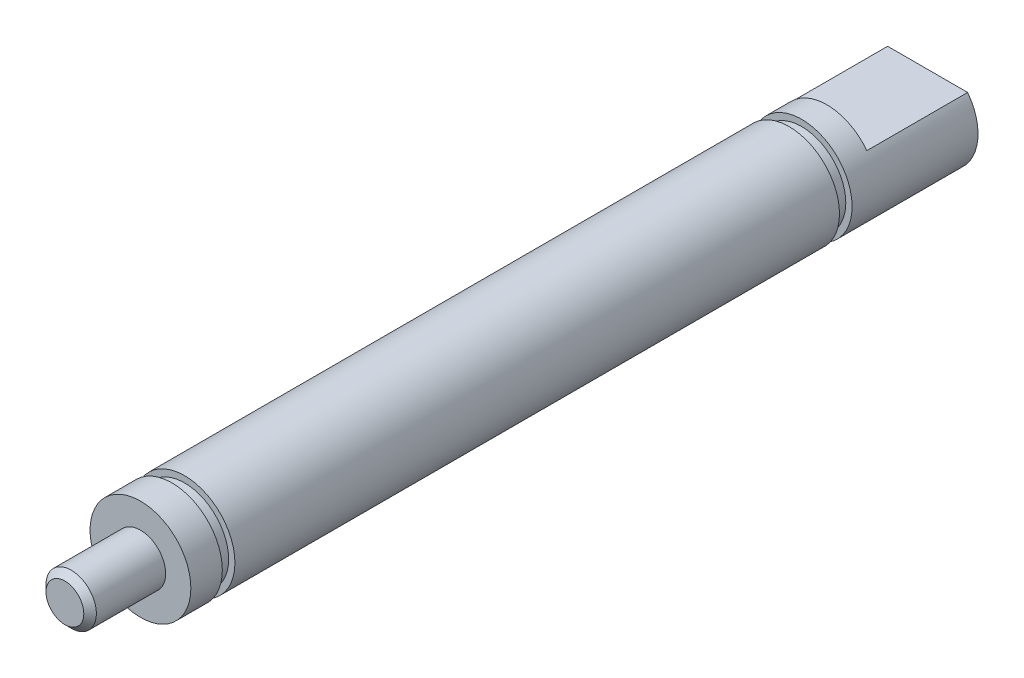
ISO-10303-21;
HEADER;
FILE_DESCRIPTION(('STEP AP214'),'2;1');
FILE_NAME('part.step','',(''),(''),'','','');
FILE_SCHEMA(('AUTOMOTIVE_DESIGN { 1 0 10303 214 1 1 1 1 }'));
ENDSEC;
DATA;
#1=APPLICATION_CONTEXT('core data for automotive mechanical design processes');
#2=APPLICATION_PROTOCOL_DEFINITION('international standard','automotive_design',2000,#1);
#3=PRODUCT_CONTEXT('',#1,'mechanical');
#4=PRODUCT('Part','Part','',(#3));
#5=PRODUCT_RELATED_PRODUCT_CATEGORY('part','',(#4));
#6=PRODUCT_DEFINITION_FORMATION('','',#4);
#7=PRODUCT_DEFINITION_CONTEXT('part definition',#1,'design');
#8=PRODUCT_DEFINITION('design','',#6,#7);
#9=PRODUCT_DEFINITION_SHAPE('','',#8);
#10=(LENGTH_UNIT() NAMED_UNIT(*) SI_UNIT(.MILLI.,.METRE.));
#11=(NAMED_UNIT(*) PLANE_ANGLE_UNIT() SI_UNIT($,.RADIAN.));
#12=(NAMED_UNIT(*) SI_UNIT($,.STERADIAN.) SOLID_ANGLE_UNIT());
#13=UNCERTAINTY_MEASURE_WITH_UNIT(LENGTH_MEASURE(1.E-05),#10,'distance_accuracy_value','');
#14=(GEOMETRIC_REPRESENTATION_CONTEXT(3) GLOBAL_UNCERTAINTY_ASSIGNED_CONTEXT((#13)) GLOBAL_UNIT_ASSIGNED_CONTEXT((#10,
#11,#12)) REPRESENTATION_CONTEXT('',''));
#15=CARTESIAN_POINT('',(0.,0.,0.));
#16=DIRECTION('',(0.,0.,1.));
#17=DIRECTION('',(1.,0.,0.));
#18=AXIS2_PLACEMENT_3D('',#15,#16,#17);
#19=CARTESIAN_POINT('',(0.,0.,31.25));
#20=DIRECTION('',(0.,0.,1.));
#21=DIRECTION('',(1.,0.,0.));
#22=AXIS2_PLACEMENT_3D('',#19,#20,#21);
#23=PLANE('',#22);
#24=CARTESIAN_POINT('',(0.,0.,31.25));
#25=DIRECTION('',(0.,0.,1.));
#26=DIRECTION('',(1.,0.,0.));
#27=AXIS2_PLACEMENT_3D('',#24,#25,#26);
#28=CIRCLE('',#27,2.);
#29=CARTESIAN_POINT('',(2.,0.,31.25));
#30=VERTEX_POINT('',#29);
#31=EDGE_CURVE('E224',#30,#30,#28,.T.);
#32=ORIENTED_EDGE('',*,*,#31,.T.);
#33=EDGE_LOOP('',(#32));
#34=FACE_BOUND('',#33,.T.);
#35=CARTESIAN_POINT('',(0.,0.,31.25));
#36=DIRECTION('',(0.,0.,1.));
#37=DIRECTION('',(1.,0.,0.));
#38=AXIS2_PLACEMENT_3D('',#35,#36,#37);
#39=CIRCLE('',#38,1.);
#40=CARTESIAN_POINT('',(1.,0.,31.25));
#41=VERTEX_POINT('',#40);
#42=EDGE_CURVE('E229',#41,#41,#39,.T.);
#43=ORIENTED_EDGE('',*,*,#42,.F.);
#44=EDGE_LOOP('',(#43));
#45=FACE_BOUND('',#44,.T.);
#46=ADVANCED_FACE('F26',(#34,#45),#23,.T.);
#47=CARTESIAN_POINT('',(0.,0.,30.));
#48=DIRECTION('',(0.,0.,1.));
#49=DIRECTION('',(1.,0.,0.));
#50=AXIS2_PLACEMENT_3D('',#47,#48,#49);
#51=PLANE('',#50);
#52=CARTESIAN_POINT('',(0.,0.,30.));
#53=DIRECTION('',(0.,0.,1.));
#54=DIRECTION('',(1.,0.,0.));
#55=AXIS2_PLACEMENT_3D('',#52,#53,#54);
#56=CIRCLE('',#55,2.);
#57=CARTESIAN_POINT('',(2.,0.,30.));
#58=VERTEX_POINT('',#57);
#59=EDGE_CURVE('E226',#58,#58,#56,.T.);
#60=ORIENTED_EDGE('',*,*,#59,.F.);
#61=EDGE_LOOP('',(#60));
#62=FACE_BOUND('',#61,.T.);
#63=CARTESIAN_POINT('',(0.,0.,30.));
#64=DIRECTION('',(0.,0.,1.));
#65=DIRECTION('',(1.,0.,0.));
#66=AXIS2_PLACEMENT_3D('',#63,#64,#65);
#67=CIRCLE('',#66,1.75);
#68=CARTESIAN_POINT('',(1.75,0.,30.));
#69=VERTEX_POINT('',#68);
#70=EDGE_CURVE('E218',#69,#69,#67,.T.);
#71=ORIENTED_EDGE('',*,*,#70,.T.);
#72=EDGE_LOOP('',(#71));
#73=FACE_BOUND('',#72,.T.);
#74=ADVANCED_FACE('F98',(#62,#73),#51,.F.);
#75=CARTESIAN_POINT('',(0.,0.,31.25));
#76=DIRECTION('',(0.,0.,-1.));
#77=DIRECTION('',(-1.,0.,0.));
#78=AXIS2_PLACEMENT_3D('',#75,#76,#77);
#79=CYLINDRICAL_SURFACE('',#78,2.);
#80=ORIENTED_EDGE('',*,*,#31,.F.);
#81=EDGE_LOOP('',(#80));
#82=FACE_BOUND('',#81,.T.);
#83=ORIENTED_EDGE('',*,*,#59,.T.);
#84=EDGE_LOOP('',(#83));
#85=FACE_BOUND('',#84,.T.);
#86=ADVANCED_FACE('F104',(#82,#85),#79,.T.);
#87=CARTESIAN_POINT('',(0.,0.,29.5));
#88=DIRECTION('',(0.,0.,1.));
#89=DIRECTION('',(1.,0.,0.));
#90=AXIS2_PLACEMENT_3D('',#87,#88,#89);
#91=PLANE('',#90);
#92=CARTESIAN_POINT('',(0.,0.,29.5));
#93=DIRECTION('',(0.,0.,1.));
#94=DIRECTION('',(1.,0.,0.));
#95=AXIS2_PLACEMENT_3D('',#92,#93,#94);
#96=CIRCLE('',#95,2.);
#97=CARTESIAN_POINT('',(2.,0.,29.5));
#98=VERTEX_POINT('',#97);
#99=EDGE_CURVE('E211',#98,#98,#96,.T.);
#100=ORIENTED_EDGE('',*,*,#99,.T.);
#101=EDGE_LOOP('',(#100));
#102=FACE_BOUND('',#101,.T.);
#103=CARTESIAN_POINT('',(0.,0.,29.5));
#104=DIRECTION('',(0.,0.,1.));
#105=DIRECTION('',(1.,0.,0.));
#106=AXIS2_PLACEMENT_3D('',#103,#104,#105);
#107=CIRCLE('',#106,1.75);
#108=CARTESIAN_POINT('',(1.75,0.,29.5));
#109=VERTEX_POINT('',#108);
#110=EDGE_CURVE('E221',#109,#109,#107,.T.);
#111=ORIENTED_EDGE('',*,*,#110,.F.);
#112=EDGE_LOOP('',(#111));
#113=FACE_BOUND('',#112,.T.);
#114=ADVANCED_FACE('F112',(#102,#113),#91,.T.);
#115=CARTESIAN_POINT('',(0.,0.,5.5));
#116=DIRECTION('',(0.,0.,1.));
#117=DIRECTION('',(1.,0.,0.));
#118=AXIS2_PLACEMENT_3D('',#115,#116,#117);
#119=PLANE('',#118);
#120=CARTESIAN_POINT('',(0.,0.,5.5));
#121=DIRECTION('',(0.,0.,1.));
#122=DIRECTION('',(1.,0.,0.));
#123=AXIS2_PLACEMENT_3D('',#120,#121,#122);
#124=CIRCLE('',#123,2.);
#125=CARTESIAN_POINT('',(2.,0.,5.5));
#126=VERTEX_POINT('',#125);
#127=EDGE_CURVE('E213',#126,#126,#124,.T.);
#128=ORIENTED_EDGE('',*,*,#127,.F.);
#129=EDGE_LOOP('',(#128));
#130=FACE_BOUND('',#129,.T.);
#131=CARTESIAN_POINT('',(0.,0.,5.5));
#132=DIRECTION('',(0.,0.,1.));
#133=DIRECTION('',(1.,0.,0.));
#134=AXIS2_PLACEMENT_3D('',#131,#132,#133);
#135=CIRCLE('',#134,1.75);
#136=CARTESIAN_POINT('',(1.75,0.,5.5));
#137=VERTEX_POINT('',#136);
#138=EDGE_CURVE('E67',#137,#137,#135,.T.);
#139=ORIENTED_EDGE('',*,*,#138,.T.);
#140=EDGE_LOOP('',(#139));
#141=FACE_BOUND('',#140,.T.);
#142=ADVANCED_FACE('F118',(#130,#141),#119,.F.);
#143=CARTESIAN_POINT('',(0.,0.,29.5));
#144=DIRECTION('',(0.,0.,-1.));
#145=DIRECTION('',(-1.,0.,0.));
#146=AXIS2_PLACEMENT_3D('',#143,#144,#145);
#147=CYLINDRICAL_SURFACE('',#146,2.);
#148=ORIENTED_EDGE('',*,*,#99,.F.);
#149=EDGE_LOOP('',(#148));
#150=FACE_BOUND('',#149,.T.);
#151=ORIENTED_EDGE('',*,*,#127,.T.);
#152=EDGE_LOOP('',(#151));
#153=FACE_BOUND('',#152,.T.);
#154=ADVANCED_FACE('F121',(#150,#153),#147,.T.);
#155=CARTESIAN_POINT('',(0.,0.,5.));
#156=DIRECTION('',(0.,0.,1.));
#157=DIRECTION('',(1.,0.,0.));
#158=AXIS2_PLACEMENT_3D('',#155,#156,#157);
#159=PLANE('',#158);
#160=CARTESIAN_POINT('',(0.,0.,5.));
#161=DIRECTION('',(0.,0.,1.));
#162=DIRECTION('',(1.,0.,0.));
#163=AXIS2_PLACEMENT_3D('',#160,#161,#162);
#164=CIRCLE('',#163,2.);
#165=CARTESIAN_POINT('',(2.,0.,5.));
#166=VERTEX_POINT('',#165);
#167=EDGE_CURVE('E66',#166,#166,#164,.T.);
#168=ORIENTED_EDGE('',*,*,#167,.T.);
#169=EDGE_LOOP('',(#168));
#170=FACE_BOUND('',#169,.T.);
#171=CARTESIAN_POINT('',(0.,0.,5.));
#172=DIRECTION('',(0.,0.,1.));
#173=DIRECTION('',(1.,0.,0.));
#174=AXIS2_PLACEMENT_3D('',#171,#172,#173);
#175=CIRCLE('',#174,1.75);
#176=CARTESIAN_POINT('',(1.75,0.,5.));
#177=VERTEX_POINT('',#176);
#178=EDGE_CURVE('E72',#177,#177,#175,.T.);
#179=ORIENTED_EDGE('',*,*,#178,.F.);
#180=EDGE_LOOP('',(#179));
#181=FACE_BOUND('',#180,.T.);
#182=ADVANCED_FACE('F128',(#170,#181),#159,.T.);
#183=CARTESIAN_POINT('',(0.,0.,4.));
#184=DIRECTION('',(0.,0.,1.));
#185=DIRECTION('',(1.,0.,0.));
#186=AXIS2_PLACEMENT_3D('',#183,#184,#185);
#187=PLANE('',#186);
#188=DIRECTION('',(1.,0.,0.));
#189=VECTOR('',#188,1.);
#190=CARTESIAN_POINT('',(-1.58739525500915,1.21662496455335,4.));
#191=LINE('',#190,#189);
#192=CARTESIAN_POINT('',(-1.58739525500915,1.21662496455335,4.));
#193=VERTEX_POINT('',#192);
#194=CARTESIAN_POINT('',(1.58739525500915,1.21662496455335,4.));
#195=VERTEX_POINT('',#194);
#196=EDGE_CURVE('E52',#193,#195,#191,.T.);
#197=ORIENTED_EDGE('',*,*,#196,.F.);
#198=CARTESIAN_POINT('',(0.,0.,4.));
#199=DIRECTION('',(0.,0.,1.));
#200=DIRECTION('',(1.,0.,0.));
#201=AXIS2_PLACEMENT_3D('',#198,#199,#200);
#202=CIRCLE('',#201,2.);
#203=EDGE_CURVE('E61',#195,#193,#202,.T.);
#204=ORIENTED_EDGE('',*,*,#203,.F.);
#205=EDGE_LOOP('',(#197,#204));
#206=FACE_BOUND('',#205,.T.);
#207=ADVANCED_FACE('F65',(#206),#187,.F.);
#208=CARTESIAN_POINT('',(0.,0.,4.));
#209=DIRECTION('',(0.,0.,-1.));
#210=DIRECTION('',(-1.,0.,0.));
#211=AXIS2_PLACEMENT_3D('',#208,#209,#210);
#212=CYLINDRICAL_SURFACE('',#211,2.);
#213=DIRECTION('',(0.,0.,-1.));
#214=VECTOR('',#213,1.);
#215=CARTESIAN_POINT('',(1.58739525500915,1.21662496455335,4.));
#216=LINE('',#215,#214);
#217=CARTESIAN_POINT('',(1.58739525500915,1.21662496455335,0.));
#218=VERTEX_POINT('',#217);
#219=EDGE_CURVE('E54',#195,#218,#216,.T.);
#220=ORIENTED_EDGE('',*,*,#219,.F.);
#221=ORIENTED_EDGE('',*,*,#203,.T.);
#222=DIRECTION('',(0.,0.,-1.));
#223=VECTOR('',#222,1.);
#224=CARTESIAN_POINT('',(-1.58739525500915,1.21662496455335,4.));
#225=LINE('',#224,#223);
#226=CARTESIAN_POINT('',(-1.58739525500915,1.21662496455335,0.));
#227=VERTEX_POINT('',#226);
#228=EDGE_CURVE('E41',#193,#227,#225,.T.);
#229=ORIENTED_EDGE('',*,*,#228,.T.);
#230=CARTESIAN_POINT('',(0.,0.,0.));
#231=DIRECTION('',(0.,0.,1.));
#232=DIRECTION('',(1.,0.,0.));
#233=AXIS2_PLACEMENT_3D('',#230,#231,#232);
#234=CIRCLE('',#233,2.);
#235=EDGE_CURVE('E62',#227,#218,#234,.T.);
#236=ORIENTED_EDGE('',*,*,#235,.T.);
#237=EDGE_LOOP('',(#220,#221,#229,#236));
#238=FACE_BOUND('',#237,.T.);
#239=ORIENTED_EDGE('',*,*,#167,.F.);
#240=EDGE_LOOP('',(#239));
#241=FACE_BOUND('',#240,.T.);
#242=ADVANCED_FACE('F59',(#238,#241),#212,.T.);
#243=CARTESIAN_POINT('',(-1.58739525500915,1.21662496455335,4.));
#244=DIRECTION('',(0.,1.,0.));
#245=DIRECTION('',(0.,0.,1.));
#246=AXIS2_PLACEMENT_3D('',#243,#244,#245);
#247=PLANE('',#246);
#248=ORIENTED_EDGE('',*,*,#196,.T.);
#249=ORIENTED_EDGE('',*,*,#219,.T.);
#250=DIRECTION('',(1.,0.,0.));
#251=VECTOR('',#250,1.);
#252=CARTESIAN_POINT('',(-1.58739525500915,1.21662496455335,0.));
#253=LINE('',#252,#251);
#254=EDGE_CURVE('E57',#227,#218,#253,.T.);
#255=ORIENTED_EDGE('',*,*,#254,.F.);
#256=ORIENTED_EDGE('',*,*,#228,.F.);
#257=EDGE_LOOP('',(#248,#249,#255,#256));
#258=FACE_BOUND('',#257,.T.);
#259=ADVANCED_FACE('F28',(#258),#247,.T.);
#260=CARTESIAN_POINT('',(0.,0.,0.));
#261=DIRECTION('',(0.,0.,1.));
#262=DIRECTION('',(1.,0.,0.));
#263=AXIS2_PLACEMENT_3D('',#260,#261,#262);
#264=PLANE('',#263);
#265=ORIENTED_EDGE('',*,*,#235,.F.);
#266=ORIENTED_EDGE('',*,*,#254,.T.);
#267=EDGE_LOOP('',(#265,#266));
#268=FACE_BOUND('',#267,.T.);
#269=ADVANCED_FACE('F132',(#268),#264,.F.);
#270=CARTESIAN_POINT('',(0.,0.,5.5));
#271=DIRECTION('',(0.,0.,-1.));
#272=DIRECTION('',(-1.,0.,0.));
#273=AXIS2_PLACEMENT_3D('',#270,#271,#272);
#274=CYLINDRICAL_SURFACE('',#273,1.75);
#275=ORIENTED_EDGE('',*,*,#138,.F.);
#276=EDGE_LOOP('',(#275));
#277=FACE_BOUND('',#276,.T.);
#278=ORIENTED_EDGE('',*,*,#178,.T.);
#279=EDGE_LOOP('',(#278));
#280=FACE_BOUND('',#279,.T.);
#281=ADVANCED_FACE('F116',(#277,#280),#274,.T.);
#282=CARTESIAN_POINT('',(0.,0.,30.));
#283=DIRECTION('',(0.,0.,-1.));
#284=DIRECTION('',(-1.,0.,0.));
#285=AXIS2_PLACEMENT_3D('',#282,#283,#284);
#286=CYLINDRICAL_SURFACE('',#285,1.75);
#287=ORIENTED_EDGE('',*,*,#70,.F.);
#288=EDGE_LOOP('',(#287));
#289=FACE_BOUND('',#288,.T.);
#290=ORIENTED_EDGE('',*,*,#110,.T.);
#291=EDGE_LOOP('',(#290));
#292=FACE_BOUND('',#291,.T.);
#293=ADVANCED_FACE('F92',(#289,#292),#286,.T.);
#294=CARTESIAN_POINT('',(0.,0.,34.25));
#295=DIRECTION('',(0.,0.,-1.));
#296=DIRECTION('',(-1.,0.,0.));
#297=AXIS2_PLACEMENT_3D('',#294,#295,#296);
#298=CYLINDRICAL_SURFACE('',#297,1.);
#299=CARTESIAN_POINT('',(0.,0.,34.));
#300=DIRECTION('',(0.,0.,1.));
#301=DIRECTION('',(1.,0.,0.));
#302=AXIS2_PLACEMENT_3D('',#299,#300,#301);
#303=CIRCLE('',#302,1.);
#304=CARTESIAN_POINT('',(1.,0.,34.));
#305=VERTEX_POINT('',#304);
#306=EDGE_CURVE('E11',#305,#305,#303,.F.);
#307=ORIENTED_EDGE('',*,*,#306,.T.);
#308=EDGE_LOOP('',(#307));
#309=FACE_BOUND('',#308,.T.);
#310=ORIENTED_EDGE('',*,*,#42,.T.);
#311=EDGE_LOOP('',(#310));
#312=FACE_BOUND('',#311,.T.);
#313=ADVANCED_FACE('F87',(#309,#312),#298,.T.);
#314=CARTESIAN_POINT('',(0.,0.,34.25));
#315=DIRECTION('',(0.,0.,1.));
#316=DIRECTION('',(1.,0.,0.));
#317=AXIS2_PLACEMENT_3D('',#314,#315,#316);
#318=PLANE('',#317);
#319=CARTESIAN_POINT('',(0.,0.,34.25));
#320=DIRECTION('',(0.,0.,1.));
#321=DIRECTION('',(1.,0.,0.));
#322=AXIS2_PLACEMENT_3D('',#319,#320,#321);
#323=CIRCLE('',#322,0.749999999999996);
#324=CARTESIAN_POINT('',(0.749999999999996,0.,34.25));
#325=VERTEX_POINT('',#324);
#326=EDGE_CURVE('E34',#325,#325,#323,.T.);
#327=ORIENTED_EDGE('',*,*,#326,.T.);
#328=EDGE_LOOP('',(#327));
#329=FACE_BOUND('',#328,.T.);
#330=ADVANCED_FACE('F81',(#329),#318,.T.);
#331=CARTESIAN_POINT('',(0.,0.,34.25));
#332=DIRECTION('',(0.,0.,-1.));
#333=DIRECTION('',(-1.,0.,0.));
#334=AXIS2_PLACEMENT_3D('',#331,#332,#333);
#335=CONICAL_SURFACE('',#334,0.749999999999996,0.785398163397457);
#336=ORIENTED_EDGE('',*,*,#306,.F.);
#337=EDGE_LOOP('',(#336));
#338=FACE_BOUND('',#337,.T.);
#339=ORIENTED_EDGE('',*,*,#326,.F.);
#340=EDGE_LOOP('',(#339));
#341=FACE_BOUND('',#340,.T.);
#342=ADVANCED_FACE('F83',(#338,#341),#335,.T.);
#343=CLOSED_SHELL('',(#46,#74,#86,#114,#142,#154,#182,#207,#242,#259,#269,#281,#293,#313,#330,#342));
#344=MANIFOLD_SOLID_BREP('B2',#343);
#345=ADVANCED_BREP_SHAPE_REPRESENTATION('',(#18,#344),#14);
#346=SHAPE_DEFINITION_REPRESENTATION(#9,#345);
ENDSEC;
END-ISO-10303-21;
